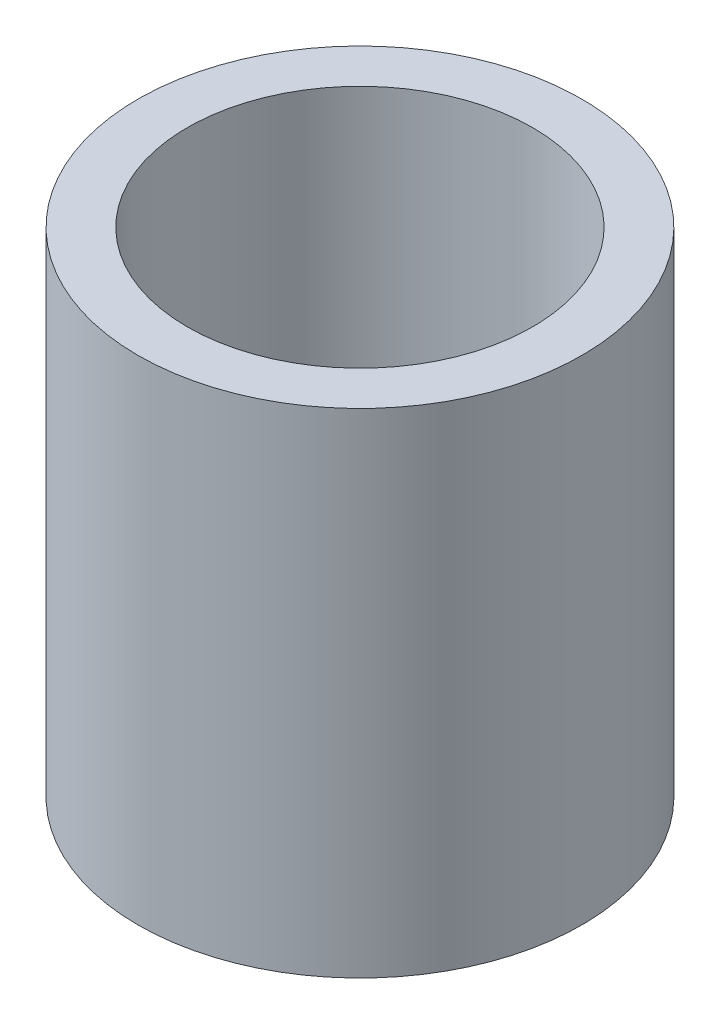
from build123d import *

# Parameters (mm, degrees)
SKETCH1_R      = 22.5
SKETCH1_R_2    = 17.5
EXTRUDE1_DEPTH = 50


with BuildPart() as part:
    # Sketch1 → Extrude1 (new body)
    with BuildSketch(Plane(origin=(0, 0, 0), x_dir=(1, 0, 0), z_dir=(0, 1, 0))):
        with Locations(Location((0, 0, 0), (0, 0, 270))):
            Circle(SKETCH1_R)
        with Locations(Location((0, 0, 0), (0, 0, 270))):
            Circle(SKETCH1_R_2, mode=Mode.SUBTRACT)
    extrude(amount=EXTRUDE1_DEPTH)


solid = part.part
